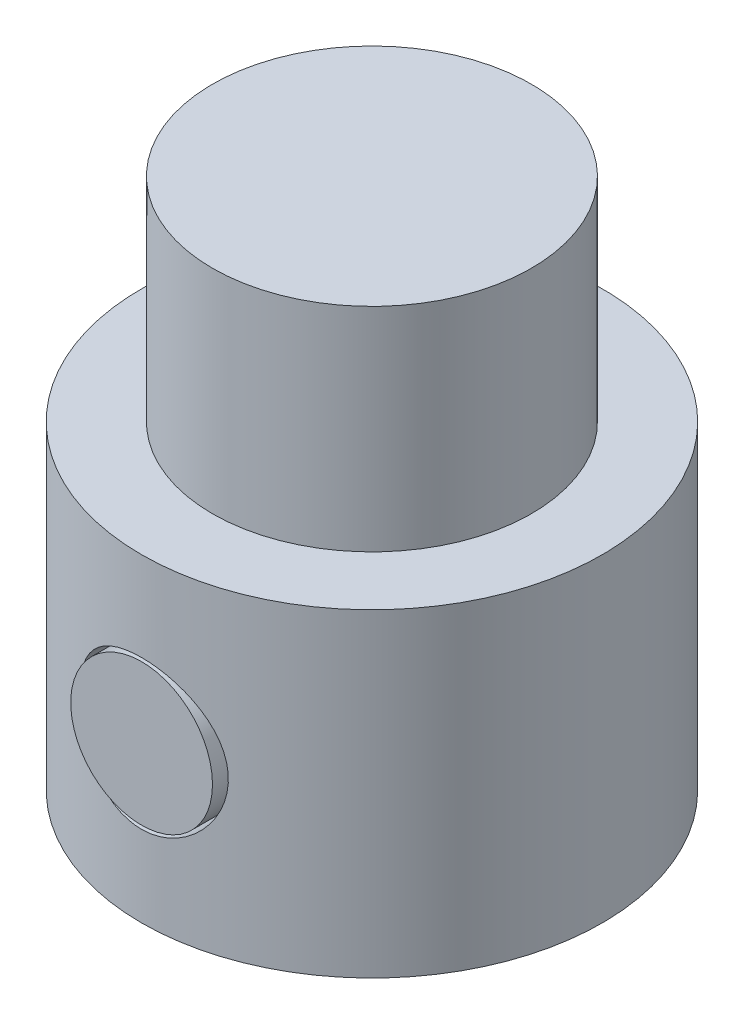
from build123d import *

# Parameters (mm, degrees)
CROQUIS1_R              = 6.5
SALIENTE_EXTRUIR1_DEPTH = 9
CROQUIS2_R              = 4.5
SALIENTE_EXTRUIR2_DEPTH = 6
CROQUIS3_R              = 2.1
CORTAR_EXTRUIR1_DEPTH   = 9
CROQUIS4_R              = 2
SALIENTE_EXTRUIR3_DEPTH = 6.5


with BuildPart() as part:
    # Croquis1 → Saliente-Extruir1 (new body)
    with BuildSketch(Plane(origin=(0, 0, 0), x_dir=(1, 0, 0), z_dir=(0, 1, 0))):
        with Locations(Location((0, 0, 0), (0, 0, 270))):
            Circle(CROQUIS1_R)
    extrude(amount=SALIENTE_EXTRUIR1_DEPTH)

    # Croquis2 → Saliente-Extruir2 (add)
    with BuildSketch(Plane(origin=(0, 9, 0), x_dir=(1, 0, 0), z_dir=(0, 1, 0))):
        with Locations(Location((0, 0, 0), (0, 0, 270))):
            Circle(CROQUIS2_R)
    extrude(amount=SALIENTE_EXTRUIR2_DEPTH)

    # Croquis3 → Cortar-Extruir1 (cut)
    with BuildSketch(Plane.XY):
        with Locations(Location((0, 4.38808988, 0), (0, 0, 180))):
            Circle(CROQUIS3_R)
    extrude(amount=CORTAR_EXTRUIR1_DEPTH, mode=Mode.SUBTRACT)

    # Croquis4 → Saliente-Extruir3 (add, through all)
    with BuildSketch(Plane.XY):
        with Locations((0, 4.38808988)):
            Circle(CROQUIS4_R)
    extrude(amount=SALIENTE_EXTRUIR3_DEPTH)


solid = part.part
